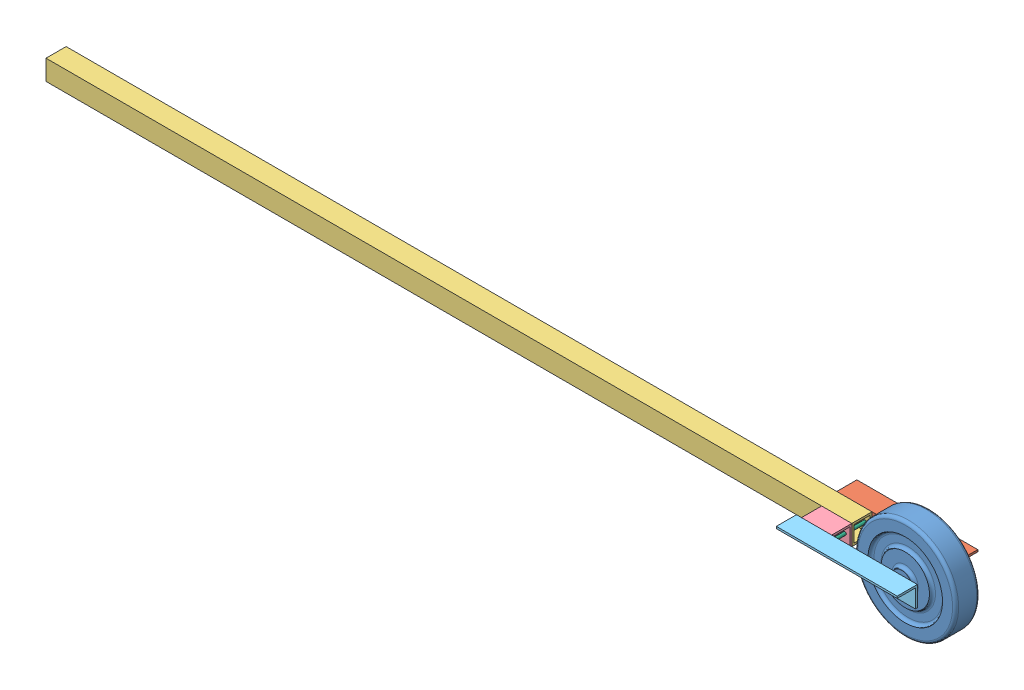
SolidWorks assembly meter 10071602.SLDASM, configuration ﾃﾞﾌｫﾙﾄ (file format 4100). Lengths in mm.
Overall size (915 100 80).
9 component instances, 8 part files, 22 mates.
Components (placement in the parent):
- wheel 100x25 whole 8-2: wheel 100x25 whole 8.SLDPRT [ﾃﾞﾌｫﾙﾄ] at origin size (100 100 31)
- shaft 40 8-3: shaft 40 8.SLDPRT [ﾃﾞﾌｫﾙﾄ] at (-8.4951 -8.4951 -21.9241) x (-1 0 0) z (0 0 1) (suppressed, hidden)
- LAngle 20x20x100 01-1: LAngle 20x20x100 01.SLDPRT [ﾃﾞﾌｫﾙﾄ] at (20 10 -20) x (-1 0 0) z (0 0 1) size (120 20 20)
- handle 20x20x800 01-1: handle 20x20x800 01.SLDPRT [ﾃﾞﾌｫﾙﾄ] at (-65 0 -10) x (-1 0 0) z (0 0 1) size (800 20 20)
- handle 20x20x30 02-1: handle 20x20x30 02.SLDPRT [ﾃﾞﾌｫﾙﾄ] at (-65 0 10) x (-1 0 0) z (0 0 1) size (30 20 20)
- LAngle 20x20x100 02-1: LAngle 20x20x100 02.SLDPRT [ﾃﾞﾌｫﾙﾄ] at (20 10 20) x (-1 0 0) z (0 0 1) size (120 20 20)
- screw 50 3-2: screw 50 3.SLDPRT [ﾃﾞﾌｫﾙﾄ] at (-90 0 -22) size (5 5 52)
- screw 50 3-3: screw 50 3.SLDPRT [ﾃﾞﾌｫﾙﾄ] at (-70 0 -22) size (5 5 52)
- shaft 50 8-1: shaft 50 8.SLDPRT [ﾃﾞﾌｫﾙﾄ] at (0 0 -25) size (8 8 50)
Mates (geometry in assembly coordinates):
- 同心円4: concentric anti-aligned: cylinder of wheel 100x25 whole 8-2 through (-8.4951 -8.4951 -12.4241) axis (0 0 1) radius 4; cylinder of shaft 40 8-3 through (-8.4951 -8.4951 28.0759) axis (0 0 -1) radius 4
- 距離4: distance = 25 mm: point of wheel 100x25 whole 8-2; point of shaft 40 8-3
- 同心円5: concentric aligned: cylinder of LAngle 20x20x100 01-1 through (-78.4951 -8.4951 -36.9241) axis (0 0 1) radius 1.5; cylinder of handle 20x20x800 01-1 through (-78.4951 -8.4951 -16.9241) axis (0 0 1) radius 1.5
- 同心円6: concentric aligned: cylinder of LAngle 20x20x100 01-1 through (-98.4951 -8.4951 -36.9241) axis (0 0 1) radius 1.5; cylinder of handle 20x20x800 01-1 through (-98.4951 -8.4951 -16.9241) axis (0 0 1) radius 1.5
- 一致8: coincident anti-aligned: plane of LAngle 20x20x100 01-1 through (-108.4951 1.5049 -16.9241) normal (0 0 1); plane of handle 20x20x800 01-1 through (-873.4951 1.5049 -16.9241) normal (0 0 -1)
- 同心円7: concentric aligned: cylinder of handle 20x20x800 01-1 through (-78.4951 -8.4951 -16.9241) axis (0 0 1) radius 1.5; cylinder of handle 20x20x30 02-1 through (-78.4951 -8.4951 3.0759) axis (0 0 1) radius 1.5
- 同心円8: concentric aligned: cylinder of handle 20x20x800 01-1 through (-98.4951 -8.4951 -16.9241) axis (0 0 1) radius 1.5; cylinder of handle 20x20x30 02-1 through (-98.4951 -8.4951 3.0759) axis (0 0 1) radius 1.5
- 一致9: coincident anti-aligned: plane of handle 20x20x800 01-1 through (-873.4951 1.5049 3.0759) normal (0 0 1); plane of handle 20x20x30 02-1 through (-103.4951 1.5049 3.0759) normal (0 0 -1)
- 同心円9: concentric anti-aligned: cylinder of handle 20x20x30 02-1 through (-78.4951 -8.4951 3.0759) axis (0 0 1) radius 1.5; cylinder of LAngle 20x20x100 02-1 through (-78.4951 -8.4951 43.0759) axis (0 0 -1) radius 1.5
- 同心円10: concentric anti-aligned: cylinder of handle 20x20x30 02-1 through (-98.4951 -8.4951 3.0759) axis (0 0 1) radius 1.5; cylinder of LAngle 20x20x100 02-1 through (-98.4951 -8.4951 43.0759) axis (0 0 -1) radius 1.5
- 一致10: coincident anti-aligned: plane of handle 20x20x30 02-1 through (-103.4951 1.5049 23.0759) normal (0 0 1); plane of LAngle 20x20x100 02-1 through (-108.4951 1.5049 23.0759) normal (0 0 -1)
- 同心円11: concentric anti-aligned: cylinder of shaft 40 8-3 through (-8.4951 -8.4951 28.0759) axis (0 0 -1) radius 4; cylinder of LAngle 20x20x100 01-1 through (-8.4951 -8.4951 -39.8864) axis (0 0 1) radius 4
- 同心円12: concentric anti-aligned: cylinder of LAngle 20x20x100 01-1 through (-98.4951 -8.4951 -36.9241) axis (0 0 1) radius 1.5; cylinder of screw 50 3-2 through (-98.4951 -8.4951 31.0759) axis (0 0 -1) radius 1.5
- 一致13: coincident anti-aligned: plane of LAngle 20x20x100 01-1 through (-108.4951 -18.4951 -18.9241) normal (0 0 -1); plane of screw 50 3-2 through (-98.4951 -8.4951 -18.9241) normal (0 0 1)
- 同心円13: concentric anti-aligned: cylinder of LAngle 20x20x100 01-1 through (-78.4951 -8.4951 -36.9241) axis (0 0 1) radius 1.5; cylinder of screw 50 3-3 through (-78.4951 -8.4951 31.0759) axis (0 0 -1) radius 1.5
- 一致14: coincident anti-aligned: plane of LAngle 20x20x100 01-1 through (-108.4951 -18.4951 -18.9241) normal (0 0 -1); plane of screw 50 3-3 through (-78.4951 -8.4951 -18.9241) normal (0 0 1)
- 同心円14: concentric anti-aligned: cylinder of shaft 40 8-3 through (-8.4951 -8.4951 28.0759) axis (0 0 -1) radius 4; cylinder of LAngle 20x20x100 01-1 through (-8.4951 -8.4951 -39.8864) axis (0 0 1) radius 4
- 距離7: distance = 20 mm: point of wheel 100x25 whole 8-2; plane of LAngle 20x20x100 01-1 through (-100 10 -20) normal (0 0 1)
- 同心円15: concentric anti-aligned: cylinder of wheel 100x25 whole 8-2 through (-8.4951 -8.4951 -12.4241) axis (0 0 1) radius 4; cylinder of shaft 50 8-1 through (-8.4951 -8.4951 28.0759) axis (0 0 -1) radius 4
- 距離8: distance = 25 mm: point of shaft 50 8-1; point of wheel 100x25 whole 8-2
- 同心円16: concentric anti-aligned: cylinder of LAngle 20x20x100 01-1 through (-8.4951 -8.4951 -36.9241) axis (0 0 1) radius 4; cylinder of shaft 50 8-1 through (-8.4951 -8.4951 28.0759) axis (0 0 -1) radius 4
- 一致16: coordinate: point of wheel 100x25 whole 8-2; point of assembly
